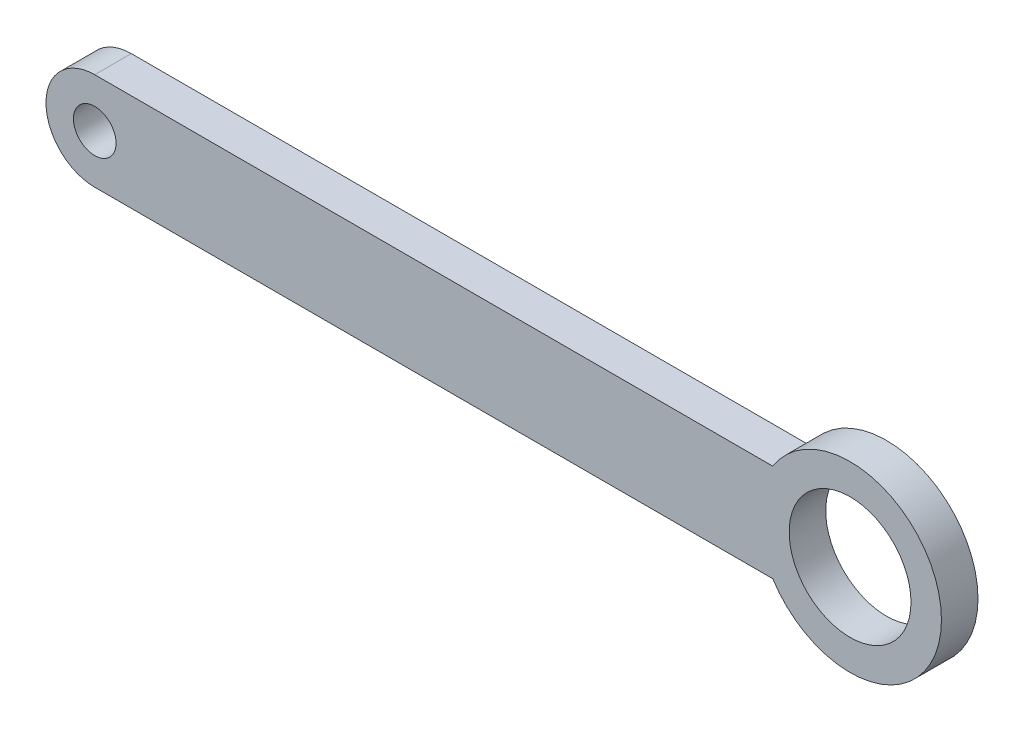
from build123d import *

# Parameters (mm, degrees)
ESQUISSE1_R        = 5
ESQUISSE1_R_2      = 1.75
BOSS_EXTRU_1_DEPTH = 3


with BuildPart() as part:
    # Esquisse1 → Boss.-Extru.1 (new body)
    with BuildSketch(Plane.XY):
        with BuildLine():
            Line((-62, 4), (-6.34428877, 4))
            ThreePointArc((-6.34428877, 4), (7.5, 0), (-6.34428877, -4))
            Line((-6.34428877, -4), (-62, -4))
            ThreePointArc((-62, -4), (-66, 0), (-62, 4))
        make_face()
        Circle(ESQUISSE1_R, mode=Mode.SUBTRACT)
        with Locations((-62, 0)):
            Circle(ESQUISSE1_R_2, mode=Mode.SUBTRACT)
    extrude(amount=BOSS_EXTRU_1_DEPTH)


solid = part.part
